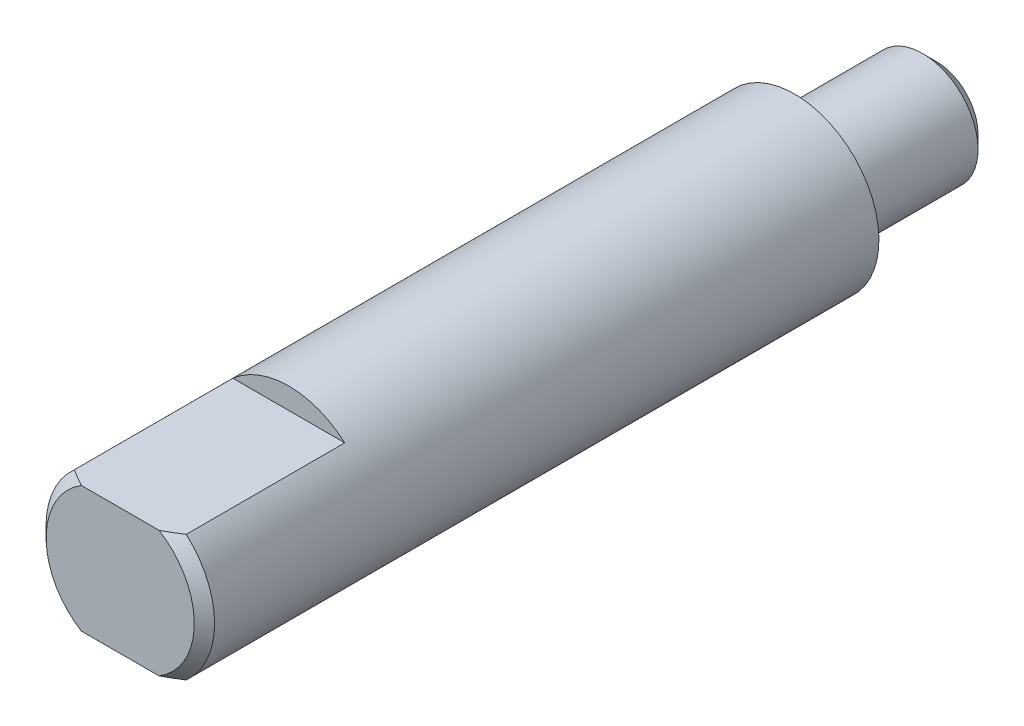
ISO-10303-21;
HEADER;
FILE_DESCRIPTION(('STEP AP214'),'2;1');
FILE_NAME('part.step','',(''),(''),'','','');
FILE_SCHEMA(('AUTOMOTIVE_DESIGN { 1 0 10303 214 1 1 1 1 }'));
ENDSEC;
DATA;
#1=APPLICATION_CONTEXT('core data for automotive mechanical design processes');
#2=APPLICATION_PROTOCOL_DEFINITION('international standard','automotive_design',2000,#1);
#3=PRODUCT_CONTEXT('',#1,'mechanical');
#4=PRODUCT('Part','Part','',(#3));
#5=PRODUCT_RELATED_PRODUCT_CATEGORY('part','',(#4));
#6=PRODUCT_DEFINITION_FORMATION('','',#4);
#7=PRODUCT_DEFINITION_CONTEXT('part definition',#1,'design');
#8=PRODUCT_DEFINITION('design','',#6,#7);
#9=PRODUCT_DEFINITION_SHAPE('','',#8);
#10=(LENGTH_UNIT() NAMED_UNIT(*) SI_UNIT(.MILLI.,.METRE.));
#11=(NAMED_UNIT(*) PLANE_ANGLE_UNIT() SI_UNIT($,.RADIAN.));
#12=(NAMED_UNIT(*) SI_UNIT($,.STERADIAN.) SOLID_ANGLE_UNIT());
#13=UNCERTAINTY_MEASURE_WITH_UNIT(LENGTH_MEASURE(1.E-05),#10,'distance_accuracy_value','');
#14=(GEOMETRIC_REPRESENTATION_CONTEXT(3) GLOBAL_UNCERTAINTY_ASSIGNED_CONTEXT((#13)) GLOBAL_UNIT_ASSIGNED_CONTEXT((#10,
#11,#12)) REPRESENTATION_CONTEXT('',''));
#15=CARTESIAN_POINT('',(0.,0.,0.));
#16=DIRECTION('',(0.,0.,1.));
#17=DIRECTION('',(1.,0.,0.));
#18=AXIS2_PLACEMENT_3D('',#15,#16,#17);
#19=CARTESIAN_POINT('',(0.,0.,3.684));
#20=DIRECTION('',(0.,0.,-1.));
#21=DIRECTION('',(0.,1.,0.));
#22=AXIS2_PLACEMENT_3D('',#19,#20,#21);
#23=CONICAL_SURFACE('',#22,3.175,0.791934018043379);
#24=CARTESIAN_POINT('',(0.,0.,3.684));
#25=DIRECTION('',(0.,0.,1.));
#26=DIRECTION('',(0.,-1.,0.));
#27=AXIS2_PLACEMENT_3D('',#24,#25,#26);
#28=CIRCLE('',#27,3.175);
#29=CARTESIAN_POINT('',(-2.10713075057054,2.375,3.684));
#30=VERTEX_POINT('',#29);
#31=CARTESIAN_POINT('',(-2.10713075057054,-2.375,3.684));
#32=VERTEX_POINT('',#31);
#33=EDGE_CURVE('E105',#30,#32,#28,.T.);
#34=ORIENTED_EDGE('',*,*,#33,.T.);
#35=CARTESIAN_POINT('',(-6.62966945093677,-2.375,-0.13301595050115));
#36=CARTESIAN_POINT('',(-6.41872085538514,-2.375,0.0629362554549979));
#37=CARTESIAN_POINT('',(-6.20729327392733,-2.375,0.258380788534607));
#38=CARTESIAN_POINT('',(-5.78286017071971,-2.375,0.647887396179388));
#39=CARTESIAN_POINT('',(-5.56985352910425,-2.375,0.841948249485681));
#40=CARTESIAN_POINT('',(-5.13574053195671,-2.375,1.23363349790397));
#41=CARTESIAN_POINT('',(-4.91457904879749,-2.375,1.43119690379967));
#42=CARTESIAN_POINT('',(-4.46963283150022,-2.375,1.82304516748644));
#43=CARTESIAN_POINT('',(-4.24585006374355,-2.375,2.01733224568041));
#44=CARTESIAN_POINT('',(-3.90719638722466,-2.375,2.30510248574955));
#45=CARTESIAN_POINT('',(-3.79385459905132,-2.375,2.40038380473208));
#46=CARTESIAN_POINT('',(-3.56590809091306,-2.375,2.58942155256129));
#47=CARTESIAN_POINT('',(-3.4513034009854,-2.375,2.68317801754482));
#48=CARTESIAN_POINT('',(-3.22025369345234,-2.375,2.86895465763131));
#49=CARTESIAN_POINT('',(-3.10380502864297,-2.375,2.96097030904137));
#50=CARTESIAN_POINT('',(-2.86892224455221,-2.375,3.14241965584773));
#51=CARTESIAN_POINT('',(-2.75048831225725,-2.375,3.23185359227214));
#52=CARTESIAN_POINT('',(-2.51255729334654,-2.375,3.40617108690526));
#53=CARTESIAN_POINT('',(-2.39309165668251,-2.375,3.49109735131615));
#54=CARTESIAN_POINT('',(-2.15090508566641,-2.375,3.65634247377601));
#55=CARTESIAN_POINT('',(-2.02818269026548,-2.375,3.73665921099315));
#56=CARTESIAN_POINT('',(-1.77912466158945,-2.375,3.89039659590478));
#57=CARTESIAN_POINT('',(-1.6528052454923,-2.375,3.96384327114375));
#58=CARTESIAN_POINT('',(-1.39512518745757,-2.375,4.10119391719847));
#59=CARTESIAN_POINT('',(-1.26377071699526,-2.375,4.16510912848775));
#60=CARTESIAN_POINT('',(-1.05701971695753,-2.375,4.25273595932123));
#61=CARTESIAN_POINT('',(-0.983728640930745,-2.375,4.28140199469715));
#62=CARTESIAN_POINT('',(-0.835356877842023,-2.375,4.33377721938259));
#63=CARTESIAN_POINT('',(-0.760275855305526,-2.375,4.35748547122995));
#64=CARTESIAN_POINT('',(-0.608898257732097,-2.375,4.39885359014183));
#65=CARTESIAN_POINT('',(-0.532610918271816,-2.375,4.41654679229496));
#66=CARTESIAN_POINT('',(-0.378780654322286,-2.375,4.445154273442));
#67=CARTESIAN_POINT('',(-0.301238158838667,-2.375,4.45607082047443));
#68=CARTESIAN_POINT('',(-0.144559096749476,-2.375,4.47054748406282));
#69=CARTESIAN_POINT('',(-0.0654144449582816,-2.375,4.47402190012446));
#70=CARTESIAN_POINT('',(0.0928249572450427,-2.375,4.47312081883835));
#71=CARTESIAN_POINT('',(0.171919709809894,-2.375,4.4687456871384));
#72=CARTESIAN_POINT('',(0.329626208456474,-2.375,4.45241265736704));
#73=CARTESIAN_POINT('',(0.408234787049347,-2.375,4.44042470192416));
#74=CARTESIAN_POINT('',(0.564086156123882,-2.375,4.40957980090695));
#75=CARTESIAN_POINT('',(0.641328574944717,-2.375,4.39072101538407));
#76=CARTESIAN_POINT('',(0.827865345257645,-2.375,4.33746225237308));
#77=CARTESIAN_POINT('',(0.936246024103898,-2.375,4.29987709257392));
#78=CARTESIAN_POINT('',(1.14927492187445,-2.375,4.21535984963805));
#79=CARTESIAN_POINT('',(1.25392057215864,-2.375,4.16842147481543));
#80=CARTESIAN_POINT('',(1.46087103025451,-2.375,4.06709514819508));
#81=CARTESIAN_POINT('',(1.56313950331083,-2.375,4.01263383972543));
#82=CARTESIAN_POINT('',(1.71427099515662,-2.375,3.92703840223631));
#83=CARTESIAN_POINT('',(1.76426245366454,-2.375,3.89786057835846));
#84=CARTESIAN_POINT('',(1.86356372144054,-2.375,3.83837009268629));
#85=CARTESIAN_POINT('',(1.91287355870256,-2.375,3.80805747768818));
#86=CARTESIAN_POINT('',(2.07522042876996,-2.375,3.70601224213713));
#87=CARTESIAN_POINT('',(2.18692206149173,-2.375,3.63215349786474));
#88=CARTESIAN_POINT('',(2.4077231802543,-2.375,3.48062951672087));
#89=CARTESIAN_POINT('',(2.51682205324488,-2.375,3.40296339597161));
#90=CARTESIAN_POINT('',(2.73301390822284,-2.375,3.24473477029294));
#91=CARTESIAN_POINT('',(2.84010537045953,-2.375,3.16417019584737));
#92=CARTESIAN_POINT('',(3.0526172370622,-2.375,3.00086187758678));
#93=CARTESIAN_POINT('',(3.15803753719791,-2.375,2.91811799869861));
#94=CARTESIAN_POINT('',(3.47300086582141,-2.375,2.66679989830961));
#95=CARTESIAN_POINT('',(3.68051445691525,-2.375,2.4956856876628));
#96=CARTESIAN_POINT('',(4.09182405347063,-2.375,2.14926116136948));
#97=CARTESIAN_POINT('',(4.2956216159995,-2.375,1.97395267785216));
#98=CARTESIAN_POINT('',(4.67931232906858,-2.375,1.63905531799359));
#99=CARTESIAN_POINT('',(4.85946034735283,-2.375,1.47975783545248));
#100=CARTESIAN_POINT('',(5.21824582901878,-2.375,1.15942835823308));
#101=CARTESIAN_POINT('',(5.39688309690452,-2.375,0.998396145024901));
#102=CARTESIAN_POINT('',(5.75173692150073,-2.375,0.676174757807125));
#103=CARTESIAN_POINT('',(5.92796166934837,-2.375,0.514994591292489));
#104=CARTESIAN_POINT('',(6.27946145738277,-2.375,0.191659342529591));
#105=CARTESIAN_POINT('',(6.45473664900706,-2.375,0.0295044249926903));
#106=CARTESIAN_POINT('',(6.62966945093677,-2.375,-0.13301595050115));
#107=B_SPLINE_CURVE_WITH_KNOTS('',3,(#35,#36,#37,#38,#39,#40,#41,#42,#43,#44,#45,#46,#47,#48,
#49,#50,#51,#52,#53,#54,#55,#56,#57,#58,#59,#60,#61,#62,#63,#64,#65,#66,#67,#68,#69,#70,#71,#72,
#73,#74,#75,#76,#77,#78,#79,#80,#81,#82,#83,#84,#85,#86,#87,#88,#89,#90,#91,#92,#93,#94,#95,#96,
#97,#98,#99,#100,#101,#102,#103,#104,#105,#106),.UNSPECIFIED.,.F.,.F.,(4,2,2,2,2,2,2,2,2,2,2,2,
2,2,2,2,2,2,2,2,2,2,2,2,2,2,2,2,2,2,2,2,2,2,2,4),(0.,0.863760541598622,1.72820709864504,
2.6178487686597,3.5068610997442,3.95106286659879,4.39525409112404,4.84047397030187,
5.28565214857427,5.72530383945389,6.16515621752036,6.60326828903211,7.04085953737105,
7.27681206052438,7.51280915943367,7.747476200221,7.98206465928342,8.21934033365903,
8.45660495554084,8.69481223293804,8.93308334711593,9.27660606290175,9.62036064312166,
9.96774119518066,10.1413805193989,10.3150126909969,10.7166254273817,11.1183318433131,
11.5203310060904,11.9223551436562,12.7291420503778,13.535582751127,14.2569976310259,
14.9785044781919,15.6949553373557,16.4112883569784),.UNSPECIFIED.);
#108=CARTESIAN_POINT('',(-1.46406113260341,-2.375,4.064));
#109=VERTEX_POINT('',#108);
#110=EDGE_CURVE('E128',#32,#109,#107,.T.);
#111=ORIENTED_EDGE('',*,*,#110,.T.);
#112=CARTESIAN_POINT('',(0.,0.,4.064));
#113=DIRECTION('',(0.,0.,1.));
#114=DIRECTION('',(0.,-1.,0.));
#115=AXIS2_PLACEMENT_3D('',#112,#113,#114);
#116=CIRCLE('',#115,2.79);
#117=CARTESIAN_POINT('',(-1.46406113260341,2.375,4.064));
#118=VERTEX_POINT('',#117);
#119=EDGE_CURVE('E115',#118,#109,#116,.T.);
#120=ORIENTED_EDGE('',*,*,#119,.F.);
#121=CARTESIAN_POINT('',(6.62966945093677,2.375,-0.133015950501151));
#122=CARTESIAN_POINT('',(6.41872085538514,2.375,0.062936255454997));
#123=CARTESIAN_POINT('',(6.20729327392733,2.375,0.258380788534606));
#124=CARTESIAN_POINT('',(5.78286017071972,2.375,0.647887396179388));
#125=CARTESIAN_POINT('',(5.56985352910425,2.375,0.84194824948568));
#126=CARTESIAN_POINT('',(5.13574053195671,2.375,1.23363349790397));
#127=CARTESIAN_POINT('',(4.9145790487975,2.375,1.43119690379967));
#128=CARTESIAN_POINT('',(4.46963283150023,2.375,1.82304516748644));
#129=CARTESIAN_POINT('',(4.24585006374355,2.375,2.01733224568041));
#130=CARTESIAN_POINT('',(3.90719638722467,2.375,2.30510248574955));
#131=CARTESIAN_POINT('',(3.79385459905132,2.375,2.40038380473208));
#132=CARTESIAN_POINT('',(3.56590809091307,2.375,2.58942155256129));
#133=CARTESIAN_POINT('',(3.4513034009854,2.375,2.68317801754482));
#134=CARTESIAN_POINT('',(3.22025369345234,2.375,2.86895465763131));
#135=CARTESIAN_POINT('',(3.10380502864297,2.375,2.96097030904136));
#136=CARTESIAN_POINT('',(2.86892224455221,2.375,3.14241965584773));
#137=CARTESIAN_POINT('',(2.75048831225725,2.375,3.23185359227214));
#138=CARTESIAN_POINT('',(2.51255729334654,2.375,3.40617108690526));
#139=CARTESIAN_POINT('',(2.39309165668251,2.375,3.49109735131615));
#140=CARTESIAN_POINT('',(2.15090508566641,2.375,3.65634247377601));
#141=CARTESIAN_POINT('',(2.02818269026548,2.375,3.73665921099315));
#142=CARTESIAN_POINT('',(1.77912466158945,2.375,3.89039659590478));
#143=CARTESIAN_POINT('',(1.6528052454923,2.375,3.96384327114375));
#144=CARTESIAN_POINT('',(1.39512518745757,2.375,4.10119391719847));
#145=CARTESIAN_POINT('',(1.26377071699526,2.375,4.16510912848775));
#146=CARTESIAN_POINT('',(1.05701971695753,2.375,4.25273595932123));
#147=CARTESIAN_POINT('',(0.983728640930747,2.375,4.28140199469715));
#148=CARTESIAN_POINT('',(0.835356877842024,2.375,4.33377721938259));
#149=CARTESIAN_POINT('',(0.760275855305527,2.375,4.35748547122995));
#150=CARTESIAN_POINT('',(0.608898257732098,2.375,4.39885359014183));
#151=CARTESIAN_POINT('',(0.532610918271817,2.375,4.41654679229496));
#152=CARTESIAN_POINT('',(0.378780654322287,2.375,4.445154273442));
#153=CARTESIAN_POINT('',(0.301238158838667,2.375,4.45607082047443));
#154=CARTESIAN_POINT('',(0.144559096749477,2.375,4.47054748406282));
#155=CARTESIAN_POINT('',(0.0654144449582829,2.375,4.47402190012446));
#156=CARTESIAN_POINT('',(-0.0928249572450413,2.375,4.47312081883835));
#157=CARTESIAN_POINT('',(-0.171919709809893,2.375,4.4687456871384));
#158=CARTESIAN_POINT('',(-0.329626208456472,2.375,4.45241265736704));
#159=CARTESIAN_POINT('',(-0.408234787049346,2.375,4.44042470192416));
#160=CARTESIAN_POINT('',(-0.564086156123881,2.375,4.40957980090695));
#161=CARTESIAN_POINT('',(-0.641328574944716,2.375,4.39072101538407));
#162=CARTESIAN_POINT('',(-0.827865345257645,2.375,4.33746225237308));
#163=CARTESIAN_POINT('',(-0.936246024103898,2.375,4.29987709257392));
#164=CARTESIAN_POINT('',(-1.14927492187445,2.375,4.21535984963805));
#165=CARTESIAN_POINT('',(-1.25392057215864,2.375,4.16842147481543));
#166=CARTESIAN_POINT('',(-1.46087103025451,2.375,4.06709514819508));
#167=CARTESIAN_POINT('',(-1.56313950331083,2.375,4.01263383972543));
#168=CARTESIAN_POINT('',(-1.71427099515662,2.375,3.92703840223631));
#169=CARTESIAN_POINT('',(-1.76426245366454,2.375,3.89786057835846));
#170=CARTESIAN_POINT('',(-1.86356372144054,2.375,3.83837009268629));
#171=CARTESIAN_POINT('',(-1.91287355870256,2.375,3.80805747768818));
#172=CARTESIAN_POINT('',(-2.07522042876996,2.375,3.70601224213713));
#173=CARTESIAN_POINT('',(-2.18692206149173,2.375,3.63215349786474));
#174=CARTESIAN_POINT('',(-2.4077231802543,2.375,3.48062951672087));
#175=CARTESIAN_POINT('',(-2.51682205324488,2.375,3.40296339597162));
#176=CARTESIAN_POINT('',(-2.73301390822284,2.375,3.24473477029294));
#177=CARTESIAN_POINT('',(-2.84010537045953,2.375,3.16417019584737));
#178=CARTESIAN_POINT('',(-3.0526172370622,2.375,3.00086187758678));
#179=CARTESIAN_POINT('',(-3.15803753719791,2.375,2.91811799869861));
#180=CARTESIAN_POINT('',(-3.47300086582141,2.375,2.66679989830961));
#181=CARTESIAN_POINT('',(-3.68051445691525,2.375,2.4956856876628));
#182=CARTESIAN_POINT('',(-4.09182405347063,2.375,2.14926116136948));
#183=CARTESIAN_POINT('',(-4.2956216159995,2.375,1.97395267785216));
#184=CARTESIAN_POINT('',(-4.67931232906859,2.375,1.63905531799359));
#185=CARTESIAN_POINT('',(-4.85946034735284,2.375,1.47975783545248));
#186=CARTESIAN_POINT('',(-5.21824582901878,2.375,1.15942835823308));
#187=CARTESIAN_POINT('',(-5.39688309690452,2.375,0.998396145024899));
#188=CARTESIAN_POINT('',(-5.75173692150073,2.375,0.676174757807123));
#189=CARTESIAN_POINT('',(-5.92796166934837,2.375,0.514994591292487));
#190=CARTESIAN_POINT('',(-6.27946145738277,2.375,0.191659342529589));
#191=CARTESIAN_POINT('',(-6.45473664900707,2.375,0.029504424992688));
#192=CARTESIAN_POINT('',(-6.62966945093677,2.375,-0.133015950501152));
#193=B_SPLINE_CURVE_WITH_KNOTS('',3,(#121,#122,#123,#124,#125,#126,#127,#128,#129,#130,#131,
#132,#133,#134,#135,#136,#137,#138,#139,#140,#141,#142,#143,#144,#145,#146,#147,#148,#149,#150,
#151,#152,#153,#154,#155,#156,#157,#158,#159,#160,#161,#162,#163,#164,#165,#166,#167,#168,#169,
#170,#171,#172,#173,#174,#175,#176,#177,#178,#179,#180,#181,#182,#183,#184,#185,#186,#187,#188,
#189,#190,#191,#192),.UNSPECIFIED.,.F.,.F.,(4,2,2,2,2,2,2,2,2,2,2,2,2,2,2,2,2,2,2,2,2,2,2,2,2,2,
2,2,2,2,2,2,2,2,2,4),(0.,0.863760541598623,1.72820709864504,2.6178487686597,3.5068610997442,
3.95106286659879,4.39525409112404,4.84047397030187,5.28565214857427,5.72530383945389,
6.16515621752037,6.60326828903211,7.04085953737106,7.27681206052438,7.51280915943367,
7.747476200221,7.98206465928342,8.21934033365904,8.45660495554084,8.69481223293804,
8.93308334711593,9.27660606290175,9.62036064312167,9.96774119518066,10.1413805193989,
10.3150126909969,10.7166254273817,11.1183318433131,11.5203310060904,11.9223551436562,
12.7291420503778,13.5355827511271,14.2569976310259,14.9785044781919,15.6949553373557,
16.4112883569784),.UNSPECIFIED.);
#194=EDGE_CURVE('E129',#118,#30,#193,.T.);
#195=ORIENTED_EDGE('',*,*,#194,.T.);
#196=EDGE_LOOP('',(#34,#111,#120,#195));
#197=FACE_BOUND('',#196,.T.);
#198=ADVANCED_FACE('F33',(#197),#23,.T.);
#199=CARTESIAN_POINT('',(0.,0.,4.064));
#200=DIRECTION('',(0.,0.,-1.));
#201=DIRECTION('',(0.,1.,0.));
#202=AXIS2_PLACEMENT_3D('',#199,#200,#201);
#203=PLANE('',#202);
#204=ORIENTED_EDGE('',*,*,#119,.T.);
#205=DIRECTION('',(1.,0.,0.));
#206=VECTOR('',#205,1.);
#207=CARTESIAN_POINT('',(-5.,-2.375,4.064));
#208=LINE('',#207,#206);
#209=CARTESIAN_POINT('',(1.46406113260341,-2.375,4.064));
#210=VERTEX_POINT('',#209);
#211=EDGE_CURVE('E95',#109,#210,#208,.T.);
#212=ORIENTED_EDGE('',*,*,#211,.T.);
#213=CARTESIAN_POINT('',(1.46406113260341,2.375,4.064));
#214=VERTEX_POINT('',#213);
#215=EDGE_CURVE('E109',#210,#214,#116,.T.);
#216=ORIENTED_EDGE('',*,*,#215,.T.);
#217=DIRECTION('',(1.,0.,0.));
#218=VECTOR('',#217,1.);
#219=CARTESIAN_POINT('',(-5.,2.375,4.064));
#220=LINE('',#219,#218);
#221=EDGE_CURVE('E135',#118,#214,#220,.T.);
#222=ORIENTED_EDGE('',*,*,#221,.F.);
#223=EDGE_LOOP('',(#204,#212,#216,#222));
#224=FACE_BOUND('',#223,.T.);
#225=ADVANCED_FACE('F35',(#224),#203,.F.);
#226=ORIENTED_EDGE('',*,*,#215,.F.);
#227=CARTESIAN_POINT('',(2.10713075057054,-2.375,3.684));
#228=VERTEX_POINT('',#227);
#229=EDGE_CURVE('E94',#210,#228,#107,.T.);
#230=ORIENTED_EDGE('',*,*,#229,.T.);
#231=CARTESIAN_POINT('',(2.10713075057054,2.375,3.684));
#232=VERTEX_POINT('',#231);
#233=EDGE_CURVE('E101',#228,#232,#28,.T.);
#234=ORIENTED_EDGE('',*,*,#233,.T.);
#235=EDGE_CURVE('E132',#232,#214,#193,.T.);
#236=ORIENTED_EDGE('',*,*,#235,.T.);
#237=EDGE_LOOP('',(#226,#230,#234,#236));
#238=FACE_BOUND('',#237,.T.);
#239=ADVANCED_FACE('F144',(#238),#23,.T.);
#240=CARTESIAN_POINT('',(0.,0.,4.064));
#241=DIRECTION('',(0.,0.,1.));
#242=DIRECTION('',(0.,-1.,0.));
#243=AXIS2_PLACEMENT_3D('',#240,#241,#242);
#244=CYLINDRICAL_SURFACE('',#243,3.175);
#245=ORIENTED_EDGE('',*,*,#233,.F.);
#246=DIRECTION('',(0.,0.,1.));
#247=VECTOR('',#246,1.);
#248=CARTESIAN_POINT('',(2.10713075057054,-2.375,4.064));
#249=LINE('',#248,#247);
#250=CARTESIAN_POINT('',(2.10713075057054,-2.375,-2.286));
#251=VERTEX_POINT('',#250);
#252=EDGE_CURVE('E11',#228,#251,#249,.F.);
#253=ORIENTED_EDGE('',*,*,#252,.T.);
#254=CARTESIAN_POINT('',(0.,0.,-2.286));
#255=DIRECTION('',(0.,0.,-1.));
#256=DIRECTION('',(-1.,0.,0.));
#257=AXIS2_PLACEMENT_3D('',#254,#255,#256);
#258=CIRCLE('',#257,3.175);
#259=CARTESIAN_POINT('',(-2.10713075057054,-2.375,-2.286));
#260=VERTEX_POINT('',#259);
#261=EDGE_CURVE('E85',#251,#260,#258,.T.);
#262=ORIENTED_EDGE('',*,*,#261,.T.);
#263=DIRECTION('',(0.,0.,1.));
#264=VECTOR('',#263,1.);
#265=CARTESIAN_POINT('',(-2.10713075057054,-2.375,4.064));
#266=LINE('',#265,#264);
#267=EDGE_CURVE('E41',#260,#32,#266,.T.);
#268=ORIENTED_EDGE('',*,*,#267,.T.);
#269=ORIENTED_EDGE('',*,*,#33,.F.);
#270=DIRECTION('',(0.,0.,1.));
#271=VECTOR('',#270,1.);
#272=CARTESIAN_POINT('',(-2.10713075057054,2.375,4.064));
#273=LINE('',#272,#271);
#274=CARTESIAN_POINT('',(-2.10713075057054,2.375,-2.286));
#275=VERTEX_POINT('',#274);
#276=EDGE_CURVE('E118',#30,#275,#273,.F.);
#277=ORIENTED_EDGE('',*,*,#276,.T.);
#278=CARTESIAN_POINT('',(0.,0.,-2.286));
#279=DIRECTION('',(0.,0.,-1.));
#280=DIRECTION('',(-1.,0.,0.));
#281=AXIS2_PLACEMENT_3D('',#278,#279,#280);
#282=CIRCLE('',#281,3.175);
#283=CARTESIAN_POINT('',(2.10713075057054,2.375,-2.286));
#284=VERTEX_POINT('',#283);
#285=EDGE_CURVE('E121',#275,#284,#282,.T.);
#286=ORIENTED_EDGE('',*,*,#285,.T.);
#287=DIRECTION('',(0.,0.,1.));
#288=VECTOR('',#287,1.);
#289=CARTESIAN_POINT('',(2.10713075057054,2.375,4.064));
#290=LINE('',#289,#288);
#291=EDGE_CURVE('E89',#284,#232,#290,.T.);
#292=ORIENTED_EDGE('',*,*,#291,.T.);
#293=EDGE_LOOP('',(#245,#253,#262,#268,#269,#277,#286,#292));
#294=FACE_BOUND('',#293,.T.);
#295=CARTESIAN_POINT('',(0.,0.,-21.336));
#296=DIRECTION('',(0.,0.,1.));
#297=DIRECTION('',(0.,-1.,0.));
#298=AXIS2_PLACEMENT_3D('',#295,#296,#297);
#299=CIRCLE('',#298,3.17499999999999);
#300=CARTESIAN_POINT('',(0.,-3.17499999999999,-21.336));
#301=VERTEX_POINT('',#300);
#302=EDGE_CURVE('E106',#301,#301,#299,.T.);
#303=ORIENTED_EDGE('',*,*,#302,.T.);
#304=EDGE_LOOP('',(#303));
#305=FACE_BOUND('',#304,.T.);
#306=ADVANCED_FACE('F98',(#294,#305),#244,.T.);
#307=CARTESIAN_POINT('',(0.,2.08280000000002,-21.336));
#308=DIRECTION('',(0.,0.,1.));
#309=DIRECTION('',(0.,-1.,0.));
#310=AXIS2_PLACEMENT_3D('',#307,#308,#309);
#311=PLANE('',#310);
#312=ORIENTED_EDGE('',*,*,#302,.F.);
#313=EDGE_LOOP('',(#312));
#314=FACE_BOUND('',#313,.T.);
#315=CARTESIAN_POINT('',(0.,0.,-21.336));
#316=DIRECTION('',(0.,0.,1.));
#317=DIRECTION('',(0.,-1.,0.));
#318=AXIS2_PLACEMENT_3D('',#315,#316,#317);
#319=CIRCLE('',#318,2.08280000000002);
#320=CARTESIAN_POINT('',(0.,-2.08280000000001,-21.336));
#321=VERTEX_POINT('',#320);
#322=EDGE_CURVE('E111',#321,#321,#319,.T.);
#323=ORIENTED_EDGE('',*,*,#322,.T.);
#324=EDGE_LOOP('',(#323));
#325=FACE_BOUND('',#324,.T.);
#326=ADVANCED_FACE('F165',(#314,#325),#311,.F.);
#327=CARTESIAN_POINT('',(0.,0.,4.064));
#328=DIRECTION('',(0.,0.,1.));
#329=DIRECTION('',(0.,-1.,0.));
#330=AXIS2_PLACEMENT_3D('',#327,#328,#329);
#331=CYLINDRICAL_SURFACE('',#330,2.08280000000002);
#332=ORIENTED_EDGE('',*,*,#322,.F.);
#333=EDGE_LOOP('',(#332));
#334=FACE_BOUND('',#333,.T.);
#335=CARTESIAN_POINT('',(0.,0.,-26.16));
#336=DIRECTION('',(0.,0.,1.));
#337=DIRECTION('',(0.,-1.,0.));
#338=AXIS2_PLACEMENT_3D('',#335,#336,#337);
#339=CIRCLE('',#338,2.08280000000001);
#340=CARTESIAN_POINT('',(0.,-2.08280000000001,-26.16));
#341=VERTEX_POINT('',#340);
#342=EDGE_CURVE('E263',#341,#341,#339,.T.);
#343=ORIENTED_EDGE('',*,*,#342,.T.);
#344=EDGE_LOOP('',(#343));
#345=FACE_BOUND('',#344,.T.);
#346=ADVANCED_FACE('F161',(#334,#345),#331,.T.);
#347=CARTESIAN_POINT('',(0.,0.,-26.67));
#348=DIRECTION('',(0.,0.,1.));
#349=DIRECTION('',(0.,-1.,0.));
#350=AXIS2_PLACEMENT_3D('',#347,#348,#349);
#351=CONICAL_SURFACE('',#350,1.57,0.788135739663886);
#352=ORIENTED_EDGE('',*,*,#342,.F.);
#353=EDGE_LOOP('',(#352));
#354=FACE_BOUND('',#353,.T.);
#355=CARTESIAN_POINT('',(0.,0.,-26.67));
#356=DIRECTION('',(0.,0.,1.));
#357=DIRECTION('',(0.,-1.,0.));
#358=AXIS2_PLACEMENT_3D('',#355,#356,#357);
#359=CIRCLE('',#358,1.57);
#360=CARTESIAN_POINT('',(0.,-1.56999999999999,-26.67));
#361=VERTEX_POINT('',#360);
#362=EDGE_CURVE('E134',#361,#361,#359,.T.);
#363=ORIENTED_EDGE('',*,*,#362,.T.);
#364=EDGE_LOOP('',(#363));
#365=FACE_BOUND('',#364,.T.);
#366=ADVANCED_FACE('F157',(#354,#365),#351,.T.);
#367=CARTESIAN_POINT('',(0.,0.,-26.67));
#368=DIRECTION('',(0.,0.,1.));
#369=DIRECTION('',(0.,-1.,0.));
#370=AXIS2_PLACEMENT_3D('',#367,#368,#369);
#371=PLANE('',#370);
#372=ORIENTED_EDGE('',*,*,#362,.F.);
#373=EDGE_LOOP('',(#372));
#374=FACE_BOUND('',#373,.T.);
#375=ADVANCED_FACE('F154',(#374),#371,.F.);
#376=CARTESIAN_POINT('',(-5.,2.375,-2.286));
#377=DIRECTION('',(0.,0.,-1.));
#378=DIRECTION('',(-1.,0.,0.));
#379=AXIS2_PLACEMENT_3D('',#376,#377,#378);
#380=PLANE('',#379);
#381=DIRECTION('',(1.,0.,0.));
#382=VECTOR('',#381,1.);
#383=CARTESIAN_POINT('',(-5.,2.375,-2.286));
#384=LINE('',#383,#382);
#385=EDGE_CURVE('E55',#275,#284,#384,.T.);
#386=ORIENTED_EDGE('',*,*,#385,.T.);
#387=ORIENTED_EDGE('',*,*,#285,.F.);
#388=EDGE_LOOP('',(#386,#387));
#389=FACE_BOUND('',#388,.T.);
#390=ADVANCED_FACE('F152',(#389),#380,.F.);
#391=CARTESIAN_POINT('',(-5.,2.375,4.064));
#392=DIRECTION('',(0.,-1.,0.));
#393=DIRECTION('',(0.,0.,-1.));
#394=AXIS2_PLACEMENT_3D('',#391,#392,#393);
#395=PLANE('',#394);
#396=ORIENTED_EDGE('',*,*,#291,.F.);
#397=ORIENTED_EDGE('',*,*,#385,.F.);
#398=ORIENTED_EDGE('',*,*,#276,.F.);
#399=ORIENTED_EDGE('',*,*,#194,.F.);
#400=ORIENTED_EDGE('',*,*,#221,.T.);
#401=ORIENTED_EDGE('',*,*,#235,.F.);
#402=EDGE_LOOP('',(#396,#397,#398,#399,#400,#401));
#403=FACE_BOUND('',#402,.T.);
#404=ADVANCED_FACE('F147',(#403),#395,.F.);
#405=CARTESIAN_POINT('',(-5.,-2.375,4.064));
#406=DIRECTION('',(0.,1.,0.));
#407=DIRECTION('',(0.,0.,1.));
#408=AXIS2_PLACEMENT_3D('',#405,#406,#407);
#409=PLANE('',#408);
#410=ORIENTED_EDGE('',*,*,#267,.F.);
#411=DIRECTION('',(1.,0.,0.));
#412=VECTOR('',#411,1.);
#413=CARTESIAN_POINT('',(-5.,-2.375,-2.286));
#414=LINE('',#413,#412);
#415=EDGE_CURVE('E47',#260,#251,#414,.T.);
#416=ORIENTED_EDGE('',*,*,#415,.T.);
#417=ORIENTED_EDGE('',*,*,#252,.F.);
#418=ORIENTED_EDGE('',*,*,#229,.F.);
#419=ORIENTED_EDGE('',*,*,#211,.F.);
#420=ORIENTED_EDGE('',*,*,#110,.F.);
#421=EDGE_LOOP('',(#410,#416,#417,#418,#419,#420));
#422=FACE_BOUND('',#421,.T.);
#423=ADVANCED_FACE('F92',(#422),#409,.F.);
#424=CARTESIAN_POINT('',(-5.,-2.375,-2.286));
#425=DIRECTION('',(0.,0.,-1.));
#426=DIRECTION('',(-1.,0.,0.));
#427=AXIS2_PLACEMENT_3D('',#424,#425,#426);
#428=PLANE('',#427);
#429=ORIENTED_EDGE('',*,*,#415,.F.);
#430=ORIENTED_EDGE('',*,*,#261,.F.);
#431=EDGE_LOOP('',(#429,#430));
#432=FACE_BOUND('',#431,.T.);
#433=ADVANCED_FACE('F86',(#432),#428,.F.);
#434=CLOSED_SHELL('',(#198,#225,#239,#306,#326,#346,#366,#375,#390,#404,#423,#433));
#435=MANIFOLD_SOLID_BREP('B2',#434);
#436=ADVANCED_BREP_SHAPE_REPRESENTATION('',(#18,#435),#14);
#437=SHAPE_DEFINITION_REPRESENTATION(#9,#436);
ENDSEC;
END-ISO-10303-21;
